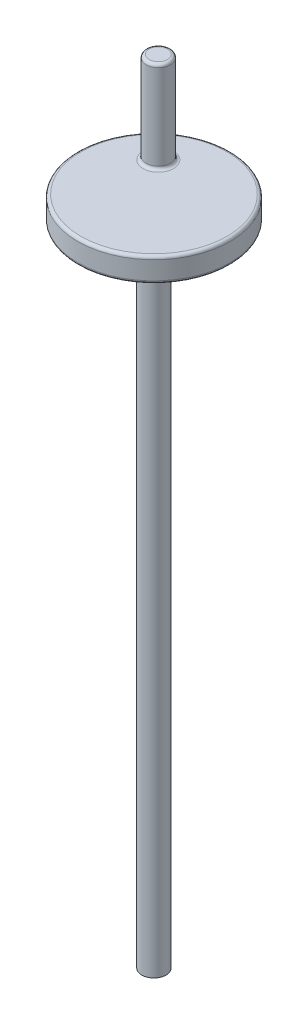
from build123d import *

# Parameters (mm, degrees)
SKETCH1_R           = 4
BOSS_EXTRUDE1_DEPTH = 220
SKETCH2_R           = 25
BOSS_EXTRUDE2_DEPTH = 8
SKETCH3_R           = 4
BOSS_EXTRUDE3_DEPTH = 30
FILLET1_R           = 1


with BuildPart() as part:
    # Sketch1 → Boss-Extrude1 (new body)
    with BuildSketch(Plane(origin=(0, 0, 0), x_dir=(1, 0, 0), z_dir=(0, 1, 0))):
        with Locations(Location((0, 0, 0), (0, 0, 270))):
            Circle(SKETCH1_R)
    extrude(amount=BOSS_EXTRUDE1_DEPTH)

    # Sketch2 → Boss-Extrude2 (add)
    with BuildSketch(Plane(origin=(0, 220, 0), x_dir=(1, 0, 0), z_dir=(0, 1, 0))):
        with Locations(Location((0, 0, 0), (0, 0, 270))):
            Circle(SKETCH2_R)
    extrude(amount=-BOSS_EXTRUDE2_DEPTH)

    # Sketch3 → Boss-Extrude3 (add)
    with BuildSketch(Plane(origin=(0, 220, 0), x_dir=(1, 0, 0), z_dir=(0, 1, 0))):
        with Locations(Location((-9.027366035, 10.468215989, 0), (0, 0, 270))):
            Circle(SKETCH3_R)
    extrude(amount=BOSS_EXTRUDE3_DEPTH)

    # Fillet1
    fillet1_edges = [part.edges().sort_by_distance(p)[0] for p in [
        (-9.027366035, 220, -14.468215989),
        (-9.027366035, 250, -14.468215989),
        (0, 220, -25),
        (0, 212, -25),
    ]]
    fillet(fillet1_edges, radius=FILLET1_R)


solid = part.part
